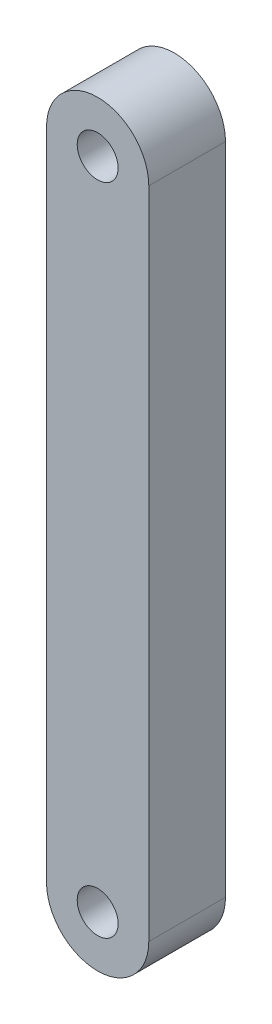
ISO-10303-21;
HEADER;
FILE_DESCRIPTION(('STEP AP214'),'2;1');
FILE_NAME('part.step','',(''),(''),'','','');
FILE_SCHEMA(('AUTOMOTIVE_DESIGN { 1 0 10303 214 1 1 1 1 }'));
ENDSEC;
DATA;
#1=APPLICATION_CONTEXT('core data for automotive mechanical design processes');
#2=APPLICATION_PROTOCOL_DEFINITION('international standard','automotive_design',2000,#1);
#3=PRODUCT_CONTEXT('',#1,'mechanical');
#4=PRODUCT('Part','Part','',(#3));
#5=PRODUCT_RELATED_PRODUCT_CATEGORY('part','',(#4));
#6=PRODUCT_DEFINITION_FORMATION('','',#4);
#7=PRODUCT_DEFINITION_CONTEXT('part definition',#1,'design');
#8=PRODUCT_DEFINITION('design','',#6,#7);
#9=PRODUCT_DEFINITION_SHAPE('','',#8);
#10=(LENGTH_UNIT() NAMED_UNIT(*) SI_UNIT(.MILLI.,.METRE.));
#11=(NAMED_UNIT(*) PLANE_ANGLE_UNIT() SI_UNIT($,.RADIAN.));
#12=(NAMED_UNIT(*) SI_UNIT($,.STERADIAN.) SOLID_ANGLE_UNIT());
#13=UNCERTAINTY_MEASURE_WITH_UNIT(LENGTH_MEASURE(1.E-05),#10,'distance_accuracy_value','');
#14=(GEOMETRIC_REPRESENTATION_CONTEXT(3) GLOBAL_UNCERTAINTY_ASSIGNED_CONTEXT((#13)) GLOBAL_UNIT_ASSIGNED_CONTEXT((#10,
#11,#12)) REPRESENTATION_CONTEXT('',''));
#15=CARTESIAN_POINT('',(0.,0.,0.));
#16=DIRECTION('',(0.,0.,1.));
#17=DIRECTION('',(1.,0.,0.));
#18=AXIS2_PLACEMENT_3D('',#15,#16,#17);
#19=CARTESIAN_POINT('',(0.,40.64,9.525));
#20=DIRECTION('',(0.,0.,1.));
#21=DIRECTION('',(1.,0.,0.));
#22=AXIS2_PLACEMENT_3D('',#19,#20,#21);
#23=PLANE('',#22);
#24=CARTESIAN_POINT('',(0.,40.64,9.525));
#25=DIRECTION('',(0.,0.,1.));
#26=DIRECTION('',(1.,0.,0.));
#27=AXIS2_PLACEMENT_3D('',#24,#25,#26);
#28=CIRCLE('',#27,2.54);
#29=CARTESIAN_POINT('',(-2.54,40.64,9.525));
#30=VERTEX_POINT('',#29);
#31=EDGE_CURVE('E99',#30,#30,#28,.T.);
#32=ORIENTED_EDGE('',*,*,#31,.F.);
#33=EDGE_LOOP('',(#32));
#34=FACE_BOUND('',#33,.T.);
#35=CARTESIAN_POINT('',(0.,40.64,9.525));
#36=DIRECTION('',(0.,0.,1.));
#37=DIRECTION('',(1.,0.,0.));
#38=AXIS2_PLACEMENT_3D('',#35,#36,#37);
#39=CIRCLE('',#38,6.35);
#40=CARTESIAN_POINT('',(6.35,40.64,9.525));
#41=VERTEX_POINT('',#40);
#42=CARTESIAN_POINT('',(-6.35,40.64,9.525));
#43=VERTEX_POINT('',#42);
#44=EDGE_CURVE('E84',#41,#43,#39,.T.);
#45=ORIENTED_EDGE('',*,*,#44,.T.);
#46=DIRECTION('',(0.,-1.,0.));
#47=VECTOR('',#46,1.);
#48=CARTESIAN_POINT('',(-6.35,-40.64,9.525));
#49=LINE('',#48,#47);
#50=CARTESIAN_POINT('',(-6.35,-40.64,9.525));
#51=VERTEX_POINT('',#50);
#52=EDGE_CURVE('E79',#43,#51,#49,.T.);
#53=ORIENTED_EDGE('',*,*,#52,.T.);
#54=CARTESIAN_POINT('',(0.,-40.64,9.525));
#55=DIRECTION('',(0.,0.,1.));
#56=DIRECTION('',(-1.,0.,0.));
#57=AXIS2_PLACEMENT_3D('',#54,#55,#56);
#58=CIRCLE('',#57,6.35);
#59=CARTESIAN_POINT('',(6.35,-40.64,9.525));
#60=VERTEX_POINT('',#59);
#61=EDGE_CURVE('E82',#51,#60,#58,.T.);
#62=ORIENTED_EDGE('',*,*,#61,.T.);
#63=DIRECTION('',(0.,1.,0.));
#64=VECTOR('',#63,1.);
#65=CARTESIAN_POINT('',(6.35,-40.64,9.525));
#66=LINE('',#65,#64);
#67=EDGE_CURVE('E49',#60,#41,#66,.T.);
#68=ORIENTED_EDGE('',*,*,#67,.T.);
#69=EDGE_LOOP('',(#45,#53,#62,#68));
#70=FACE_BOUND('',#69,.T.);
#71=CARTESIAN_POINT('',(0.,-40.64,9.525));
#72=DIRECTION('',(0.,0.,1.));
#73=DIRECTION('',(1.,0.,0.));
#74=AXIS2_PLACEMENT_3D('',#71,#72,#73);
#75=CIRCLE('',#74,2.54);
#76=CARTESIAN_POINT('',(-2.54,-40.64,9.525));
#77=VERTEX_POINT('',#76);
#78=EDGE_CURVE('E114',#77,#77,#75,.T.);
#79=ORIENTED_EDGE('',*,*,#78,.F.);
#80=EDGE_LOOP('',(#79));
#81=FACE_BOUND('',#80,.T.);
#82=ADVANCED_FACE('F32',(#34,#70,#81),#23,.T.);
#83=CARTESIAN_POINT('',(0.,40.64,0.));
#84=DIRECTION('',(0.,0.,1.));
#85=DIRECTION('',(1.,0.,0.));
#86=AXIS2_PLACEMENT_3D('',#83,#84,#85);
#87=PLANE('',#86);
#88=CARTESIAN_POINT('',(0.,40.64,0.));
#89=DIRECTION('',(0.,0.,1.));
#90=DIRECTION('',(1.,0.,0.));
#91=AXIS2_PLACEMENT_3D('',#88,#89,#90);
#92=CIRCLE('',#91,2.54);
#93=CARTESIAN_POINT('',(-2.54,40.64,0.));
#94=VERTEX_POINT('',#93);
#95=EDGE_CURVE('E111',#94,#94,#92,.T.);
#96=ORIENTED_EDGE('',*,*,#95,.T.);
#97=EDGE_LOOP('',(#96));
#98=FACE_BOUND('',#97,.T.);
#99=CARTESIAN_POINT('',(0.,40.64,0.));
#100=DIRECTION('',(0.,0.,1.));
#101=DIRECTION('',(1.,0.,0.));
#102=AXIS2_PLACEMENT_3D('',#99,#100,#101);
#103=CIRCLE('',#102,6.35);
#104=CARTESIAN_POINT('',(6.35,40.64,0.));
#105=VERTEX_POINT('',#104);
#106=CARTESIAN_POINT('',(-6.35,40.64,0.));
#107=VERTEX_POINT('',#106);
#108=EDGE_CURVE('E96',#105,#107,#103,.T.);
#109=ORIENTED_EDGE('',*,*,#108,.F.);
#110=DIRECTION('',(0.,1.,0.));
#111=VECTOR('',#110,1.);
#112=CARTESIAN_POINT('',(6.35,-40.64,0.));
#113=LINE('',#112,#111);
#114=CARTESIAN_POINT('',(6.35,-40.64,0.));
#115=VERTEX_POINT('',#114);
#116=EDGE_CURVE('E72',#115,#105,#113,.T.);
#117=ORIENTED_EDGE('',*,*,#116,.F.);
#118=CARTESIAN_POINT('',(0.,-40.64,0.));
#119=DIRECTION('',(0.,0.,1.));
#120=DIRECTION('',(-1.,0.,0.));
#121=AXIS2_PLACEMENT_3D('',#118,#119,#120);
#122=CIRCLE('',#121,6.35);
#123=CARTESIAN_POINT('',(-6.35,-40.64,0.));
#124=VERTEX_POINT('',#123);
#125=EDGE_CURVE('E66',#124,#115,#122,.T.);
#126=ORIENTED_EDGE('',*,*,#125,.F.);
#127=DIRECTION('',(0.,-1.,0.));
#128=VECTOR('',#127,1.);
#129=CARTESIAN_POINT('',(-6.35,-40.64,0.));
#130=LINE('',#129,#128);
#131=EDGE_CURVE('E88',#107,#124,#130,.T.);
#132=ORIENTED_EDGE('',*,*,#131,.F.);
#133=EDGE_LOOP('',(#109,#117,#126,#132));
#134=FACE_BOUND('',#133,.T.);
#135=CARTESIAN_POINT('',(0.,-40.64,0.));
#136=DIRECTION('',(0.,0.,1.));
#137=DIRECTION('',(1.,0.,0.));
#138=AXIS2_PLACEMENT_3D('',#135,#136,#137);
#139=CIRCLE('',#138,2.54);
#140=CARTESIAN_POINT('',(-2.54,-40.64,0.));
#141=VERTEX_POINT('',#140);
#142=EDGE_CURVE('E117',#141,#141,#139,.T.);
#143=ORIENTED_EDGE('',*,*,#142,.T.);
#144=EDGE_LOOP('',(#143));
#145=FACE_BOUND('',#144,.T.);
#146=ADVANCED_FACE('F107',(#98,#134,#145),#87,.F.);
#147=CARTESIAN_POINT('',(0.,40.64,9.525));
#148=DIRECTION('',(0.,0.,-1.));
#149=DIRECTION('',(-1.,0.,0.));
#150=AXIS2_PLACEMENT_3D('',#147,#148,#149);
#151=CYLINDRICAL_SURFACE('',#150,6.35);
#152=ORIENTED_EDGE('',*,*,#108,.T.);
#153=DIRECTION('',(0.,0.,-1.));
#154=VECTOR('',#153,1.);
#155=CARTESIAN_POINT('',(-6.35,40.64,9.525));
#156=LINE('',#155,#154);
#157=EDGE_CURVE('E11',#43,#107,#156,.T.);
#158=ORIENTED_EDGE('',*,*,#157,.F.);
#159=ORIENTED_EDGE('',*,*,#44,.F.);
#160=DIRECTION('',(0.,0.,-1.));
#161=VECTOR('',#160,1.);
#162=CARTESIAN_POINT('',(6.35,40.64,9.525));
#163=LINE('',#162,#161);
#164=EDGE_CURVE('E92',#41,#105,#163,.T.);
#165=ORIENTED_EDGE('',*,*,#164,.T.);
#166=EDGE_LOOP('',(#152,#158,#159,#165));
#167=FACE_BOUND('',#166,.T.);
#168=ADVANCED_FACE('F34',(#167),#151,.T.);
#169=CARTESIAN_POINT('',(-6.35,-40.64,9.525));
#170=DIRECTION('',(1.,0.,0.));
#171=DIRECTION('',(0.,0.,-1.));
#172=AXIS2_PLACEMENT_3D('',#169,#170,#171);
#173=PLANE('',#172);
#174=ORIENTED_EDGE('',*,*,#131,.T.);
#175=DIRECTION('',(0.,0.,-1.));
#176=VECTOR('',#175,1.);
#177=CARTESIAN_POINT('',(-6.35,-40.64,9.525));
#178=LINE('',#177,#176);
#179=EDGE_CURVE('E41',#51,#124,#178,.T.);
#180=ORIENTED_EDGE('',*,*,#179,.F.);
#181=ORIENTED_EDGE('',*,*,#52,.F.);
#182=ORIENTED_EDGE('',*,*,#157,.T.);
#183=EDGE_LOOP('',(#174,#180,#181,#182));
#184=FACE_BOUND('',#183,.T.);
#185=ADVANCED_FACE('F87',(#184),#173,.F.);
#186=CARTESIAN_POINT('',(0.,-40.64,9.525));
#187=DIRECTION('',(0.,0.,-1.));
#188=DIRECTION('',(-1.,0.,0.));
#189=AXIS2_PLACEMENT_3D('',#186,#187,#188);
#190=CYLINDRICAL_SURFACE('',#189,6.35);
#191=ORIENTED_EDGE('',*,*,#125,.T.);
#192=DIRECTION('',(0.,0.,-1.));
#193=VECTOR('',#192,1.);
#194=CARTESIAN_POINT('',(6.35,-40.64,9.525));
#195=LINE('',#194,#193);
#196=EDGE_CURVE('E89',#60,#115,#195,.T.);
#197=ORIENTED_EDGE('',*,*,#196,.F.);
#198=ORIENTED_EDGE('',*,*,#61,.F.);
#199=ORIENTED_EDGE('',*,*,#179,.T.);
#200=EDGE_LOOP('',(#191,#197,#198,#199));
#201=FACE_BOUND('',#200,.T.);
#202=ADVANCED_FACE('F90',(#201),#190,.T.);
#203=CARTESIAN_POINT('',(6.35,-40.64,9.525));
#204=DIRECTION('',(-1.,0.,0.));
#205=DIRECTION('',(0.,0.,1.));
#206=AXIS2_PLACEMENT_3D('',#203,#204,#205);
#207=PLANE('',#206);
#208=ORIENTED_EDGE('',*,*,#116,.T.);
#209=ORIENTED_EDGE('',*,*,#164,.F.);
#210=ORIENTED_EDGE('',*,*,#67,.F.);
#211=ORIENTED_EDGE('',*,*,#196,.T.);
#212=EDGE_LOOP('',(#208,#209,#210,#211));
#213=FACE_BOUND('',#212,.T.);
#214=ADVANCED_FACE('F104',(#213),#207,.F.);
#215=CARTESIAN_POINT('',(0.,40.64,9.525));
#216=DIRECTION('',(0.,0.,-1.));
#217=DIRECTION('',(-1.,0.,0.));
#218=AXIS2_PLACEMENT_3D('',#215,#216,#217);
#219=CYLINDRICAL_SURFACE('',#218,2.54);
#220=CARTESIAN_POINT('',(-2.54,40.64,9.525));
#221=CARTESIAN_POINT('',(-2.54,40.64,9.42578125));
#222=CARTESIAN_POINT('',(-2.54,40.64,9.3265625));
#223=CARTESIAN_POINT('',(-2.54,40.64,9.128125));
#224=CARTESIAN_POINT('',(-2.54,40.64,9.02890625));
#225=CARTESIAN_POINT('',(-2.54,40.64,8.83046875));
#226=CARTESIAN_POINT('',(-2.54,40.64,8.73125));
#227=CARTESIAN_POINT('',(-2.54,40.64,8.5328125));
#228=CARTESIAN_POINT('',(-2.54,40.64,8.43359375));
#229=CARTESIAN_POINT('',(-2.54,40.64,8.23515625));
#230=CARTESIAN_POINT('',(-2.54,40.64,8.1359375));
#231=CARTESIAN_POINT('',(-2.54,40.64,7.9375));
#232=CARTESIAN_POINT('',(-2.54,40.64,7.83828125));
#233=CARTESIAN_POINT('',(-2.54,40.64,7.63984375));
#234=CARTESIAN_POINT('',(-2.54,40.64,7.540625));
#235=CARTESIAN_POINT('',(-2.54,40.64,7.3421875));
#236=CARTESIAN_POINT('',(-2.54,40.64,7.24296875));
#237=CARTESIAN_POINT('',(-2.54,40.64,7.04453125));
#238=CARTESIAN_POINT('',(-2.54,40.64,6.9453125));
#239=CARTESIAN_POINT('',(-2.54,40.64,6.746875));
#240=CARTESIAN_POINT('',(-2.54,40.64,6.64765625));
#241=CARTESIAN_POINT('',(-2.54,40.64,6.44921875));
#242=CARTESIAN_POINT('',(-2.54,40.64,6.35));
#243=CARTESIAN_POINT('',(-2.54,40.64,6.1515625));
#244=CARTESIAN_POINT('',(-2.54,40.64,6.05234375));
#245=CARTESIAN_POINT('',(-2.54,40.64,5.85390625));
#246=CARTESIAN_POINT('',(-2.54,40.64,5.7546875));
#247=CARTESIAN_POINT('',(-2.54,40.64,5.55625));
#248=CARTESIAN_POINT('',(-2.54,40.64,5.45703125));
#249=CARTESIAN_POINT('',(-2.54,40.64,5.25859375));
#250=CARTESIAN_POINT('',(-2.54,40.64,5.159375));
#251=CARTESIAN_POINT('',(-2.54,40.64,4.9609375));
#252=CARTESIAN_POINT('',(-2.54,40.64,4.86171875));
#253=CARTESIAN_POINT('',(-2.54,40.64,4.66328125));
#254=CARTESIAN_POINT('',(-2.54,40.64,4.5640625));
#255=CARTESIAN_POINT('',(-2.54,40.64,4.365625));
#256=CARTESIAN_POINT('',(-2.54,40.64,4.26640625));
#257=CARTESIAN_POINT('',(-2.54,40.64,4.06796875));
#258=CARTESIAN_POINT('',(-2.54,40.64,3.96875));
#259=CARTESIAN_POINT('',(-2.54,40.64,3.7703125));
#260=CARTESIAN_POINT('',(-2.54,40.64,3.67109375));
#261=CARTESIAN_POINT('',(-2.54,40.64,3.47265625));
#262=CARTESIAN_POINT('',(-2.54,40.64,3.3734375));
#263=CARTESIAN_POINT('',(-2.54,40.64,3.175));
#264=CARTESIAN_POINT('',(-2.54,40.64,3.07578125));
#265=CARTESIAN_POINT('',(-2.54,40.64,2.87734375));
#266=CARTESIAN_POINT('',(-2.54,40.64,2.778125));
#267=CARTESIAN_POINT('',(-2.54,40.64,2.5796875));
#268=CARTESIAN_POINT('',(-2.54,40.64,2.48046875));
#269=CARTESIAN_POINT('',(-2.54,40.64,2.28203125));
#270=CARTESIAN_POINT('',(-2.54,40.64,2.1828125));
#271=CARTESIAN_POINT('',(-2.54,40.64,1.984375));
#272=CARTESIAN_POINT('',(-2.54,40.64,1.88515625));
#273=CARTESIAN_POINT('',(-2.54,40.64,1.68671875));
#274=CARTESIAN_POINT('',(-2.54,40.64,1.5875));
#275=CARTESIAN_POINT('',(-2.54,40.64,1.3890625));
#276=CARTESIAN_POINT('',(-2.54,40.64,1.28984375));
#277=CARTESIAN_POINT('',(-2.54,40.64,1.09140625));
#278=CARTESIAN_POINT('',(-2.54,40.64,0.992187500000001));
#279=CARTESIAN_POINT('',(-2.54,40.64,0.793750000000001));
#280=CARTESIAN_POINT('',(-2.54,40.64,0.69453125));
#281=CARTESIAN_POINT('',(-2.54,40.64,0.49609375));
#282=CARTESIAN_POINT('',(-2.54,40.64,0.396875));
#283=CARTESIAN_POINT('',(-2.54,40.64,0.1984375));
#284=CARTESIAN_POINT('',(-2.54,40.64,0.0992187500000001));
#285=CARTESIAN_POINT('',(-2.54,40.64,0.));
#286=B_SPLINE_CURVE_WITH_KNOTS('',3,(#220,#221,#222,#223,#224,#225,#226,#227,#228,#229,#230,
#231,#232,#233,#234,#235,#236,#237,#238,#239,#240,#241,#242,#243,#244,#245,#246,#247,#248,#249,
#250,#251,#252,#253,#254,#255,#256,#257,#258,#259,#260,#261,#262,#263,#264,#265,#266,#267,#268,
#269,#270,#271,#272,#273,#274,#275,#276,#277,#278,#279,#280,#281,#282,#283,#284,#285),
.UNSPECIFIED.,.F.,.F.,(4,2,2,2,2,2,2,2,2,2,2,2,2,2,2,2,2,2,2,2,2,2,2,2,2,2,2,2,2,2,2,2,4),(0.,
0.297656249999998,0.595312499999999,0.892968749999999,1.190625,1.48828125,1.7859375,2.08359375,
2.38125,2.67890625,2.9765625,3.27421875,3.571875,3.86953125,4.1671875,4.46484375,4.7625,
5.06015625,5.3578125,5.65546875,5.953125,6.25078125,6.5484375,6.84609375,7.14375,7.44140625,
7.7390625,8.03671875,8.334375,8.63203125,8.9296875,9.22734375,9.525),.UNSPECIFIED.);
#287=EDGE_CURVE('BSEAM135',#30,#94,#286,.T.);
#288=ORIENTED_EDGE('',*,*,#31,.T.);
#289=ORIENTED_EDGE('',*,*,#95,.F.);
#290=ORIENTED_EDGE('',*,*,#287,.T.);
#291=ORIENTED_EDGE('',*,*,#287,.F.);
#292=EDGE_LOOP('',(#288,#290,#289,#291));
#293=FACE_BOUND('',#292,.T.);
#294=ADVANCED_FACE('F135',(#293),#219,.F.);
#295=CARTESIAN_POINT('',(0.,-40.64,9.525));
#296=DIRECTION('',(0.,0.,-1.));
#297=DIRECTION('',(-1.,0.,0.));
#298=AXIS2_PLACEMENT_3D('',#295,#296,#297);
#299=CYLINDRICAL_SURFACE('',#298,2.54);
#300=CARTESIAN_POINT('',(-2.54,-40.64,9.525));
#301=CARTESIAN_POINT('',(-2.54,-40.64,9.42578125));
#302=CARTESIAN_POINT('',(-2.54,-40.64,9.3265625));
#303=CARTESIAN_POINT('',(-2.54,-40.64,9.128125));
#304=CARTESIAN_POINT('',(-2.54,-40.64,9.02890625));
#305=CARTESIAN_POINT('',(-2.54,-40.64,8.83046875));
#306=CARTESIAN_POINT('',(-2.54,-40.64,8.73125));
#307=CARTESIAN_POINT('',(-2.54,-40.64,8.5328125));
#308=CARTESIAN_POINT('',(-2.54,-40.64,8.43359375));
#309=CARTESIAN_POINT('',(-2.54,-40.64,8.23515625));
#310=CARTESIAN_POINT('',(-2.54,-40.64,8.1359375));
#311=CARTESIAN_POINT('',(-2.54,-40.64,7.9375));
#312=CARTESIAN_POINT('',(-2.54,-40.64,7.83828125));
#313=CARTESIAN_POINT('',(-2.54,-40.64,7.63984375));
#314=CARTESIAN_POINT('',(-2.54,-40.64,7.540625));
#315=CARTESIAN_POINT('',(-2.54,-40.64,7.3421875));
#316=CARTESIAN_POINT('',(-2.54,-40.64,7.24296875));
#317=CARTESIAN_POINT('',(-2.54,-40.64,7.04453125));
#318=CARTESIAN_POINT('',(-2.54,-40.64,6.9453125));
#319=CARTESIAN_POINT('',(-2.54,-40.64,6.746875));
#320=CARTESIAN_POINT('',(-2.54,-40.64,6.64765625));
#321=CARTESIAN_POINT('',(-2.54,-40.64,6.44921875));
#322=CARTESIAN_POINT('',(-2.54,-40.64,6.35));
#323=CARTESIAN_POINT('',(-2.54,-40.64,6.1515625));
#324=CARTESIAN_POINT('',(-2.54,-40.64,6.05234375));
#325=CARTESIAN_POINT('',(-2.54,-40.64,5.85390625));
#326=CARTESIAN_POINT('',(-2.54,-40.64,5.7546875));
#327=CARTESIAN_POINT('',(-2.54,-40.64,5.55625));
#328=CARTESIAN_POINT('',(-2.54,-40.64,5.45703125));
#329=CARTESIAN_POINT('',(-2.54,-40.64,5.25859375));
#330=CARTESIAN_POINT('',(-2.54,-40.64,5.159375));
#331=CARTESIAN_POINT('',(-2.54,-40.64,4.9609375));
#332=CARTESIAN_POINT('',(-2.54,-40.64,4.86171875));
#333=CARTESIAN_POINT('',(-2.54,-40.64,4.66328125));
#334=CARTESIAN_POINT('',(-2.54,-40.64,4.5640625));
#335=CARTESIAN_POINT('',(-2.54,-40.64,4.365625));
#336=CARTESIAN_POINT('',(-2.54,-40.64,4.26640625));
#337=CARTESIAN_POINT('',(-2.54,-40.64,4.06796875));
#338=CARTESIAN_POINT('',(-2.54,-40.64,3.96875));
#339=CARTESIAN_POINT('',(-2.54,-40.64,3.7703125));
#340=CARTESIAN_POINT('',(-2.54,-40.64,3.67109375));
#341=CARTESIAN_POINT('',(-2.54,-40.64,3.47265625));
#342=CARTESIAN_POINT('',(-2.54,-40.64,3.3734375));
#343=CARTESIAN_POINT('',(-2.54,-40.64,3.175));
#344=CARTESIAN_POINT('',(-2.54,-40.64,3.07578125));
#345=CARTESIAN_POINT('',(-2.54,-40.64,2.87734375));
#346=CARTESIAN_POINT('',(-2.54,-40.64,2.778125));
#347=CARTESIAN_POINT('',(-2.54,-40.64,2.5796875));
#348=CARTESIAN_POINT('',(-2.54,-40.64,2.48046875));
#349=CARTESIAN_POINT('',(-2.54,-40.64,2.28203125));
#350=CARTESIAN_POINT('',(-2.54,-40.64,2.1828125));
#351=CARTESIAN_POINT('',(-2.54,-40.64,1.984375));
#352=CARTESIAN_POINT('',(-2.54,-40.64,1.88515625));
#353=CARTESIAN_POINT('',(-2.54,-40.64,1.68671875));
#354=CARTESIAN_POINT('',(-2.54,-40.64,1.5875));
#355=CARTESIAN_POINT('',(-2.54,-40.64,1.3890625));
#356=CARTESIAN_POINT('',(-2.54,-40.64,1.28984375));
#357=CARTESIAN_POINT('',(-2.54,-40.64,1.09140625));
#358=CARTESIAN_POINT('',(-2.54,-40.64,0.992187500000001));
#359=CARTESIAN_POINT('',(-2.54,-40.64,0.793750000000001));
#360=CARTESIAN_POINT('',(-2.54,-40.64,0.69453125));
#361=CARTESIAN_POINT('',(-2.54,-40.64,0.49609375));
#362=CARTESIAN_POINT('',(-2.54,-40.64,0.396875));
#363=CARTESIAN_POINT('',(-2.54,-40.64,0.1984375));
#364=CARTESIAN_POINT('',(-2.54,-40.64,0.0992187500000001));
#365=CARTESIAN_POINT('',(-2.54,-40.64,0.));
#366=B_SPLINE_CURVE_WITH_KNOTS('',3,(#300,#301,#302,#303,#304,#305,#306,#307,#308,#309,#310,
#311,#312,#313,#314,#315,#316,#317,#318,#319,#320,#321,#322,#323,#324,#325,#326,#327,#328,#329,
#330,#331,#332,#333,#334,#335,#336,#337,#338,#339,#340,#341,#342,#343,#344,#345,#346,#347,#348,
#349,#350,#351,#352,#353,#354,#355,#356,#357,#358,#359,#360,#361,#362,#363,#364,#365),
.UNSPECIFIED.,.F.,.F.,(4,2,2,2,2,2,2,2,2,2,2,2,2,2,2,2,2,2,2,2,2,2,2,2,2,2,2,2,2,2,2,2,4),(0.,
0.297656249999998,0.595312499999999,0.892968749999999,1.190625,1.48828125,1.7859375,2.08359375,
2.38125,2.67890625,2.9765625,3.27421875,3.571875,3.86953125,4.1671875,4.46484375,4.7625,
5.06015625,5.3578125,5.65546875,5.953125,6.25078125,6.5484375,6.84609375,7.14375,7.44140625,
7.7390625,8.03671875,8.334375,8.63203125,8.9296875,9.22734375,9.525),.UNSPECIFIED.);
#367=EDGE_CURVE('BSEAM123',#77,#141,#366,.T.);
#368=ORIENTED_EDGE('',*,*,#78,.T.);
#369=ORIENTED_EDGE('',*,*,#142,.F.);
#370=ORIENTED_EDGE('',*,*,#367,.T.);
#371=ORIENTED_EDGE('',*,*,#367,.F.);
#372=EDGE_LOOP('',(#368,#370,#369,#371));
#373=FACE_BOUND('',#372,.T.);
#374=ADVANCED_FACE('F123',(#373),#299,.F.);
#375=CLOSED_SHELL('',(#82,#146,#168,#185,#202,#214,#294,#374));
#376=MANIFOLD_SOLID_BREP('B2',#375);
#377=ADVANCED_BREP_SHAPE_REPRESENTATION('',(#18,#376),#14);
#378=SHAPE_DEFINITION_REPRESENTATION(#9,#377);
ENDSEC;
END-ISO-10303-21;
